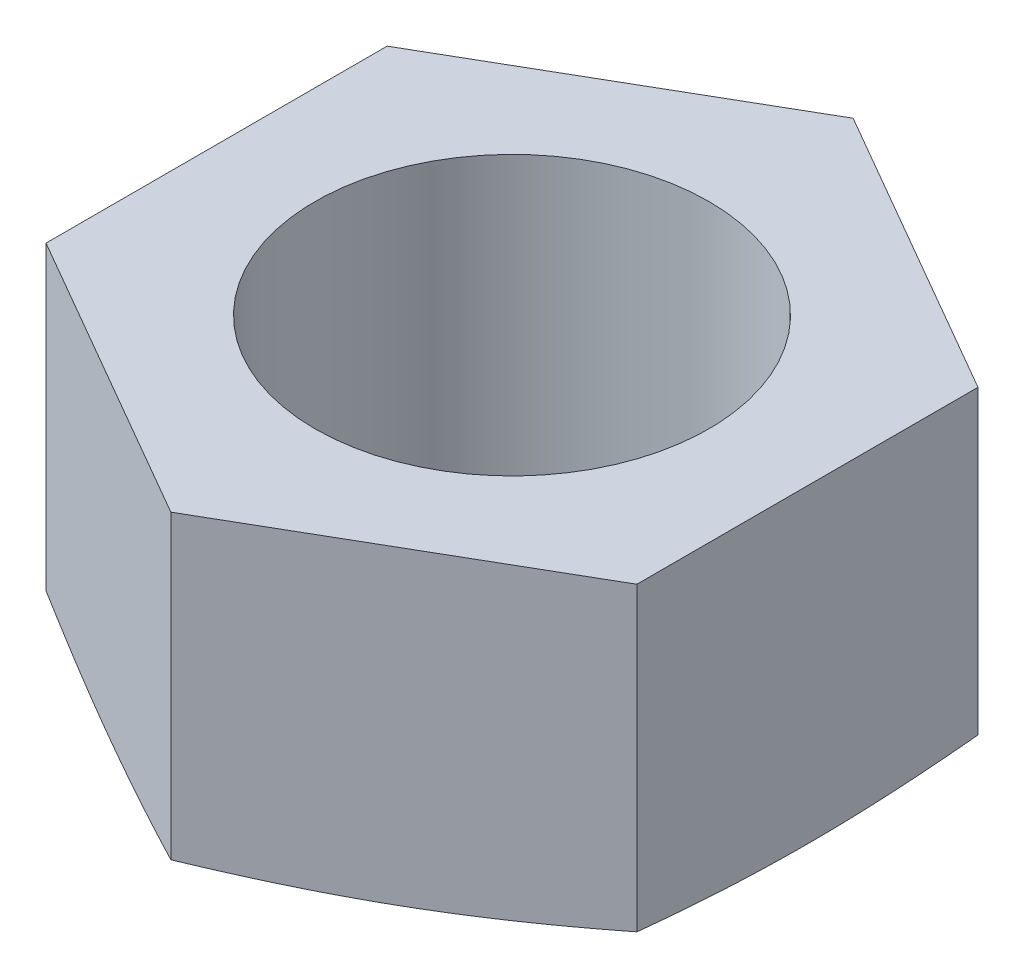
ISO-10303-21;
HEADER;
FILE_DESCRIPTION(('STEP AP214'),'2;1');
FILE_NAME('part.step','',(''),(''),'','','');
FILE_SCHEMA(('AUTOMOTIVE_DESIGN { 1 0 10303 214 1 1 1 1 }'));
ENDSEC;
DATA;
#1=APPLICATION_CONTEXT('core data for automotive mechanical design processes');
#2=APPLICATION_PROTOCOL_DEFINITION('international standard','automotive_design',2000,#1);
#3=PRODUCT_CONTEXT('',#1,'mechanical');
#4=PRODUCT('Part','Part','',(#3));
#5=PRODUCT_RELATED_PRODUCT_CATEGORY('part','',(#4));
#6=PRODUCT_DEFINITION_FORMATION('','',#4);
#7=PRODUCT_DEFINITION_CONTEXT('part definition',#1,'design');
#8=PRODUCT_DEFINITION('design','',#6,#7);
#9=PRODUCT_DEFINITION_SHAPE('','',#8);
#10=(LENGTH_UNIT() NAMED_UNIT(*) SI_UNIT(.MILLI.,.METRE.));
#11=(NAMED_UNIT(*) PLANE_ANGLE_UNIT() SI_UNIT($,.RADIAN.));
#12=(NAMED_UNIT(*) SI_UNIT($,.STERADIAN.) SOLID_ANGLE_UNIT());
#13=UNCERTAINTY_MEASURE_WITH_UNIT(LENGTH_MEASURE(1.E-05),#10,'distance_accuracy_value','');
#14=(GEOMETRIC_REPRESENTATION_CONTEXT(3) GLOBAL_UNCERTAINTY_ASSIGNED_CONTEXT((#13)) GLOBAL_UNIT_ASSIGNED_CONTEXT((#10,
#11,#12)) REPRESENTATION_CONTEXT('',''));
#15=CARTESIAN_POINT('',(0.,0.,0.));
#16=DIRECTION('',(0.,0.,1.));
#17=DIRECTION('',(1.,0.,0.));
#18=AXIS2_PLACEMENT_3D('',#15,#16,#17);
#19=CARTESIAN_POINT('',(12.,14.,6.92820323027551));
#20=DIRECTION('',(-1.,0.,0.));
#21=DIRECTION('',(0.,0.,1.));
#22=AXIS2_PLACEMENT_3D('',#19,#20,#21);
#23=PLANE('',#22);
#24=DIRECTION('',(0.,0.,-1.));
#25=VECTOR('',#24,1.);
#26=CARTESIAN_POINT('',(12.,13.,0.));
#27=LINE('',#26,#25);
#28=CARTESIAN_POINT('',(12.,13.,-6.92820323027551));
#29=VERTEX_POINT('',#28);
#30=CARTESIAN_POINT('',(12.,13.,6.92820323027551));
#31=VERTEX_POINT('',#30);
#32=EDGE_CURVE('E96',#29,#31,#27,.F.);
#33=ORIENTED_EDGE('',*,*,#32,.T.);
#34=DIRECTION('',(0.,1.,0.));
#35=VECTOR('',#34,1.);
#36=CARTESIAN_POINT('',(12.,14.,6.92820323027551));
#37=LINE('',#36,#35);
#38=CARTESIAN_POINT('',(12.,0.771281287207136,6.92820318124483));
#39=VERTEX_POINT('',#38);
#40=EDGE_CURVE('E85',#31,#39,#37,.F.);
#41=ORIENTED_EDGE('',*,*,#40,.T.);
#42=CARTESIAN_POINT('',(11.9999999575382,0.771281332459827,-6.9282032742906));
#43=CARTESIAN_POINT('',(11.9999999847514,0.713631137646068,-6.35193258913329));
#44=CARTESIAN_POINT('',(11.9999999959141,0.661350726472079,-5.77507541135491));
#45=CARTESIAN_POINT('',(12.0000000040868,0.569566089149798,-4.6202248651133));
#46=CARTESIAN_POINT('',(12.0000000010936,0.530064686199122,-4.0422312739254));
#47=CARTESIAN_POINT('',(11.9999999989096,0.465994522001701,-2.88706839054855));
#48=CARTESIAN_POINT('',(11.9999999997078,0.44138299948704,-2.30990153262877));
#49=CARTESIAN_POINT('',(12.0000000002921,0.408386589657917,-1.15515644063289));
#50=CARTESIAN_POINT('',(12.0000000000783,0.400000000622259,-0.577578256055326));
#51=CARTESIAN_POINT('',(11.9999999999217,0.399999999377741,0.577578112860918));
#52=CARTESIAN_POINT('',(11.9999999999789,0.408386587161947,1.1551562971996));
#53=CARTESIAN_POINT('',(12.0000000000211,0.441382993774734,2.30990138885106));
#54=CARTESIAN_POINT('',(12.000000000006,0.465994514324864,2.8870682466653));
#55=CARTESIAN_POINT('',(11.9999999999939,0.530064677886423,4.04223112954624));
#56=CARTESIAN_POINT('',(11.999999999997,0.569566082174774,4.62022472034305));
#57=CARTESIAN_POINT('',(12.000000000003,0.661350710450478,5.77507526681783));
#58=CARTESIAN_POINT('',(12.000000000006,0.713631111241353,6.35193244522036));
#59=CARTESIAN_POINT('',(12.,0.771281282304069,6.92820313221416));
#60=B_SPLINE_CURVE_WITH_KNOTS('',3,(#42,#43,#44,#45,#46,#47,#48,#49,#50,#51,#52,#53,#54,#55,#56,
#57,#58,#59),.UNSPECIFIED.,.F.,.F.,(4,2,2,2,2,2,2,2,4),(0.,1.73749036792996,3.47536432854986,
5.20822341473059,6.94090074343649,8.67357807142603,10.406437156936,12.1443111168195,
13.8818014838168),.UNSPECIFIED.);
#61=CARTESIAN_POINT('',(11.9999999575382,0.771281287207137,-6.92820325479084));
#62=VERTEX_POINT('',#61);
#63=EDGE_CURVE('E94',#62,#39,#60,.T.);
#64=ORIENTED_EDGE('',*,*,#63,.F.);
#65=DIRECTION('',(0.,1.,0.));
#66=VECTOR('',#65,1.);
#67=CARTESIAN_POINT('',(12.,14.,-6.92820323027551));
#68=LINE('',#67,#66);
#69=EDGE_CURVE('E102',#62,#29,#68,.T.);
#70=ORIENTED_EDGE('',*,*,#69,.T.);
#71=EDGE_LOOP('',(#33,#41,#64,#70));
#72=FACE_BOUND('',#71,.T.);
#73=ADVANCED_FACE('F17',(#72),#23,.F.);
#74=CARTESIAN_POINT('',(0.,14.,13.856406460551));
#75=DIRECTION('',(-0.5,0.,-0.866025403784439));
#76=DIRECTION('',(-0.866025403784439,0.,0.5));
#77=AXIS2_PLACEMENT_3D('',#74,#75,#76);
#78=PLANE('',#77);
#79=DIRECTION('',(-0.866025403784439,0.,0.5));
#80=VECTOR('',#79,1.);
#81=CARTESIAN_POINT('',(12.,13.,6.92820323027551));
#82=LINE('',#81,#80);
#83=CARTESIAN_POINT('',(0.,13.,13.856406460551));
#84=VERTEX_POINT('',#83);
#85=EDGE_CURVE('E79',#31,#84,#82,.T.);
#86=ORIENTED_EDGE('',*,*,#85,.T.);
#87=DIRECTION('',(0.,1.,0.));
#88=VECTOR('',#87,1.);
#89=CARTESIAN_POINT('',(0.,14.,13.856406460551));
#90=LINE('',#89,#88);
#91=CARTESIAN_POINT('',(0.,0.771281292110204,13.856406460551));
#92=VERTEX_POINT('',#91);
#93=EDGE_CURVE('E74',#84,#92,#90,.F.);
#94=ORIENTED_EDGE('',*,*,#93,.T.);
#95=CARTESIAN_POINT('',(12.0000000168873,0.771281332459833,6.92820317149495));
#96=CARTESIAN_POINT('',(11.5009349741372,0.713631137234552,7.21633853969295));
#97=CARTESIAN_POINT('',(11.001362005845,0.661350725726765,7.50476714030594));
#98=CARTESIAN_POINT('',(10.0012320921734,0.569566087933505,8.08219242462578));
#99=CARTESIAN_POINT('',(9.50067495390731,0.530064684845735,8.37118921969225));
#100=CARTESIAN_POINT('',(8.50027454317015,0.465994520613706,8.9487706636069));
#101=CARTESIAN_POINT('',(8.0004333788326,0.441382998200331,9.23735409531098));
#102=CARTESIAN_POINT('',(7.00039478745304,0.408386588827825,9.81472664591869));
#103=CARTESIAN_POINT('',(6.50019740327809,0.400000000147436,10.1035157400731));
#104=CARTESIAN_POINT('',(5.49980263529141,0.399999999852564,10.6810939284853));
#105=CARTESIAN_POINT('',(4.99960525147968,0.408386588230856,10.969883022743));
#106=CARTESIAN_POINT('',(3.99956666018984,0.441382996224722,11.5472555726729));
#107=CARTESIAN_POINT('',(3.49972549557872,0.465994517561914,11.8358390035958));
#108=CARTESIAN_POINT('',(2.49932508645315,0.530064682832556,12.4134204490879));
#109=CARTESIAN_POINT('',(1.9987679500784,0.569566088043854,12.7024172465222));
#110=CARTESIAN_POINT('',(0.998638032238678,0.66135071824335,13.2798425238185));
#111=CARTESIAN_POINT('',(0.499065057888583,0.713631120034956,13.5682711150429));
#112=CARTESIAN_POINT('',(0.,0.771281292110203,13.856406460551));
#113=B_SPLINE_CURVE_WITH_KNOTS('',3,(#95,#96,#97,#98,#99,#100,#101,#102,#103,#104,#105,#106,
#107,#108,#109,#110,#111,#112),.UNSPECIFIED.,.F.,.F.,(4,2,2,2,2,2,2,2,4),(0.,1.73749038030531,
3.47536435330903,5.20822345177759,6.94090079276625,8.67357813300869,10.4064372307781,
12.1443112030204,13.8818015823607),.UNSPECIFIED.);
#114=EDGE_CURVE('E77',#39,#92,#113,.T.);
#115=ORIENTED_EDGE('',*,*,#114,.F.);
#116=ORIENTED_EDGE('',*,*,#40,.F.);
#117=EDGE_LOOP('',(#86,#94,#115,#116));
#118=FACE_BOUND('',#117,.T.);
#119=ADVANCED_FACE('F76',(#118),#78,.F.);
#120=CARTESIAN_POINT('',(-12.,14.,6.92820323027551));
#121=DIRECTION('',(0.5,0.,-0.866025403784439));
#122=DIRECTION('',(-0.866025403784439,0.,-0.5));
#123=AXIS2_PLACEMENT_3D('',#120,#121,#122);
#124=PLANE('',#123);
#125=DIRECTION('',(-0.866025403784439,0.,-0.5));
#126=VECTOR('',#125,1.);
#127=CARTESIAN_POINT('',(0.,13.,13.856406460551));
#128=LINE('',#127,#126);
#129=CARTESIAN_POINT('',(-12.,13.,6.92820323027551));
#130=VERTEX_POINT('',#129);
#131=EDGE_CURVE('E143',#84,#130,#128,.T.);
#132=ORIENTED_EDGE('',*,*,#131,.T.);
#133=DIRECTION('',(0.,1.,0.));
#134=VECTOR('',#133,1.);
#135=CARTESIAN_POINT('',(-12.,14.,6.92820323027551));
#136=LINE('',#135,#134);
#137=CARTESIAN_POINT('',(-11.9999999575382,0.771281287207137,6.92820325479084));
#138=VERTEX_POINT('',#137);
#139=EDGE_CURVE('E84',#130,#138,#136,.F.);
#140=ORIENTED_EDGE('',*,*,#139,.T.);
#141=CARTESIAN_POINT('',(0.,0.771281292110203,13.856406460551));
#142=CARTESIAN_POINT('',(-0.499065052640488,0.713631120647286,13.5682711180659));
#143=CARTESIAN_POINT('',(-0.998638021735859,0.661350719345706,13.2798425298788));
#144=CARTESIAN_POINT('',(-1.99876792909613,0.569566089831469,12.7024172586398));
#145=CARTESIAN_POINT('',(-2.49932506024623,0.530064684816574,12.4134204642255));
#146=CARTESIAN_POINT('',(-3.49972545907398,0.46599451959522,11.8358390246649));
#147=CARTESIAN_POINT('',(-3.99956661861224,0.441382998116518,11.5472555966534));
#148=CARTESIAN_POINT('',(-4.99960519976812,0.408386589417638,10.969883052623));
#149=CARTESIAN_POINT('',(-5.49980257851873,0.400000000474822,10.6810939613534));
#150=CARTESIAN_POINT('',(-6.50019733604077,0.399999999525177,10.1035157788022));
#151=CARTESIAN_POINT('',(-7.00039471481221,0.408386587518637,9.81472668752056));
#152=CARTESIAN_POINT('',(-8.00043329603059,0.441382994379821,9.23735414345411));
#153=CARTESIAN_POINT('',(-8.50027445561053,0.465994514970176,8.94877071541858));
#154=CARTESIAN_POINT('',(-9.50067485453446,0.530064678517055,8.37118927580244));
#155=CARTESIAN_POINT('',(-10.0012319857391,0.569566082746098,8.08219248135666));
#156=CARTESIAN_POINT('',(-11.0013618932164,0.66135071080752,7.50476721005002));
#157=CARTESIAN_POINT('',(-11.5009348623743,0.713631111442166,7.21633862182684));
#158=CARTESIAN_POINT('',(-11.9999999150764,0.77128128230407,6.92820327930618));
#159=B_SPLINE_CURVE_WITH_KNOTS('',3,(#141,#142,#143,#144,#145,#146,#147,#148,#149,#150,#151,
#152,#153,#154,#155,#156,#157,#158),.UNSPECIFIED.,.F.,.F.,(4,2,2,2,2,2,2,2,4),(0.,
1.73749036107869,3.47536431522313,5.2082233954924,6.94090071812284,8.67357804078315,
10.4064371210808,12.1443110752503,13.8818014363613),.UNSPECIFIED.);
#160=EDGE_CURVE('E21',#92,#138,#159,.T.);
#161=ORIENTED_EDGE('',*,*,#160,.F.);
#162=ORIENTED_EDGE('',*,*,#93,.F.);
#163=EDGE_LOOP('',(#132,#140,#161,#162));
#164=FACE_BOUND('',#163,.T.);
#165=ADVANCED_FACE('F98',(#164),#124,.F.);
#166=CARTESIAN_POINT('',(-12.,14.,-6.92820323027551));
#167=DIRECTION('',(1.,0.,0.));
#168=DIRECTION('',(0.,0.,-1.));
#169=AXIS2_PLACEMENT_3D('',#166,#167,#168);
#170=PLANE('',#169);
#171=DIRECTION('',(0.,0.,-1.));
#172=VECTOR('',#171,1.);
#173=CARTESIAN_POINT('',(-12.,13.,0.));
#174=LINE('',#173,#172);
#175=CARTESIAN_POINT('',(-12.,13.,-6.92820323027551));
#176=VERTEX_POINT('',#175);
#177=EDGE_CURVE('E134',#130,#176,#174,.T.);
#178=ORIENTED_EDGE('',*,*,#177,.T.);
#179=DIRECTION('',(0.,1.,0.));
#180=VECTOR('',#179,1.);
#181=CARTESIAN_POINT('',(-12.,14.,-6.92820323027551));
#182=LINE('',#181,#180);
#183=CARTESIAN_POINT('',(-12.,0.771281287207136,-6.92820318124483));
#184=VERTEX_POINT('',#183);
#185=EDGE_CURVE('E108',#176,#184,#182,.F.);
#186=ORIENTED_EDGE('',*,*,#185,.T.);
#187=CARTESIAN_POINT('',(-11.9999999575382,0.771281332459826,6.9282032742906));
#188=CARTESIAN_POINT('',(-11.9999999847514,0.713631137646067,6.35193258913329));
#189=CARTESIAN_POINT('',(-11.9999999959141,0.661350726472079,5.77507541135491));
#190=CARTESIAN_POINT('',(-12.0000000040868,0.569566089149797,4.6202248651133));
#191=CARTESIAN_POINT('',(-12.0000000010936,0.530064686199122,4.0422312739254));
#192=CARTESIAN_POINT('',(-11.9999999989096,0.465994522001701,2.88706839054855));
#193=CARTESIAN_POINT('',(-11.9999999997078,0.441382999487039,2.30990153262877));
#194=CARTESIAN_POINT('',(-12.0000000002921,0.408386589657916,1.15515644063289));
#195=CARTESIAN_POINT('',(-12.0000000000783,0.400000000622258,0.577578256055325));
#196=CARTESIAN_POINT('',(-11.9999999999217,0.399999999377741,-0.577578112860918));
#197=CARTESIAN_POINT('',(-11.9999999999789,0.408386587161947,-1.1551562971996));
#198=CARTESIAN_POINT('',(-12.0000000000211,0.441382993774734,-2.30990138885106));
#199=CARTESIAN_POINT('',(-12.000000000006,0.465994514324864,-2.8870682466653));
#200=CARTESIAN_POINT('',(-11.9999999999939,0.530064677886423,-4.04223112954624));
#201=CARTESIAN_POINT('',(-11.999999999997,0.569566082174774,-4.62022472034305));
#202=CARTESIAN_POINT('',(-12.000000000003,0.661350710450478,-5.77507526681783));
#203=CARTESIAN_POINT('',(-12.000000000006,0.713631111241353,-6.35193244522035));
#204=CARTESIAN_POINT('',(-12.,0.771281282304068,-6.92820313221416));
#205=B_SPLINE_CURVE_WITH_KNOTS('',3,(#187,#188,#189,#190,#191,#192,#193,#194,#195,#196,#197,
#198,#199,#200,#201,#202,#203,#204),.UNSPECIFIED.,.F.,.F.,(4,2,2,2,2,2,2,2,4),(0.,
1.73749036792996,3.47536432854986,5.20822341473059,6.94090074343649,8.67357807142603,
10.406437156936,12.1443111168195,13.8818014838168),.UNSPECIFIED.);
#206=EDGE_CURVE('E100',#138,#184,#205,.T.);
#207=ORIENTED_EDGE('',*,*,#206,.F.);
#208=ORIENTED_EDGE('',*,*,#139,.F.);
#209=EDGE_LOOP('',(#178,#186,#207,#208));
#210=FACE_BOUND('',#209,.T.);
#211=ADVANCED_FACE('F186',(#210),#170,.F.);
#212=CARTESIAN_POINT('',(0.,14.,-13.856406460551));
#213=DIRECTION('',(0.5,0.,0.866025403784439));
#214=DIRECTION('',(0.866025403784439,0.,-0.5));
#215=AXIS2_PLACEMENT_3D('',#212,#213,#214);
#216=PLANE('',#215);
#217=DIRECTION('',(0.866025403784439,0.,-0.5));
#218=VECTOR('',#217,1.);
#219=CARTESIAN_POINT('',(-12.,13.,-6.92820323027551));
#220=LINE('',#219,#218);
#221=CARTESIAN_POINT('',(0.,13.,-13.856406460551));
#222=VERTEX_POINT('',#221);
#223=EDGE_CURVE('E130',#176,#222,#220,.T.);
#224=ORIENTED_EDGE('',*,*,#223,.T.);
#225=DIRECTION('',(0.,1.,0.));
#226=VECTOR('',#225,1.);
#227=CARTESIAN_POINT('',(0.,14.,-13.856406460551));
#228=LINE('',#227,#226);
#229=CARTESIAN_POINT('',(0.,0.771281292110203,-13.856406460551));
#230=VERTEX_POINT('',#229);
#231=EDGE_CURVE('E41',#222,#230,#228,.F.);
#232=ORIENTED_EDGE('',*,*,#231,.T.);
#233=CARTESIAN_POINT('',(-12.0000000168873,0.771281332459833,-6.92820317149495));
#234=CARTESIAN_POINT('',(-11.5009349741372,0.713631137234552,-7.21633853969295));
#235=CARTESIAN_POINT('',(-11.001362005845,0.661350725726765,-7.50476714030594));
#236=CARTESIAN_POINT('',(-10.0012320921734,0.569566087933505,-8.08219242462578));
#237=CARTESIAN_POINT('',(-9.50067495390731,0.530064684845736,-8.37118921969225));
#238=CARTESIAN_POINT('',(-8.50027454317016,0.465994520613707,-8.9487706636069));
#239=CARTESIAN_POINT('',(-8.0004333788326,0.441382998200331,-9.23735409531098));
#240=CARTESIAN_POINT('',(-7.00039478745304,0.408386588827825,-9.81472664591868));
#241=CARTESIAN_POINT('',(-6.50019740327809,0.400000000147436,-10.1035157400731));
#242=CARTESIAN_POINT('',(-5.49980263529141,0.399999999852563,-10.6810939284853));
#243=CARTESIAN_POINT('',(-4.99960525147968,0.408386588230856,-10.969883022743));
#244=CARTESIAN_POINT('',(-3.99956666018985,0.441382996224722,-11.5472555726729));
#245=CARTESIAN_POINT('',(-3.49972549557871,0.465994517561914,-11.8358390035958));
#246=CARTESIAN_POINT('',(-2.49932508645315,0.530064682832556,-12.4134204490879));
#247=CARTESIAN_POINT('',(-1.9987679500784,0.569566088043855,-12.7024172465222));
#248=CARTESIAN_POINT('',(-0.998638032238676,0.66135071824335,-13.2798425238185));
#249=CARTESIAN_POINT('',(-0.499065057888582,0.713631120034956,-13.5682711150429));
#250=CARTESIAN_POINT('',(0.,0.771281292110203,-13.856406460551));
#251=B_SPLINE_CURVE_WITH_KNOTS('',3,(#233,#234,#235,#236,#237,#238,#239,#240,#241,#242,#243,
#244,#245,#246,#247,#248,#249,#250),.UNSPECIFIED.,.F.,.F.,(4,2,2,2,2,2,2,2,4),(0.,
1.73749038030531,3.47536435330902,5.20822345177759,6.94090079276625,8.67357813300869,
10.4064372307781,12.1443112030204,13.8818015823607),.UNSPECIFIED.);
#252=EDGE_CURVE('E101',#184,#230,#251,.T.);
#253=ORIENTED_EDGE('',*,*,#252,.F.);
#254=ORIENTED_EDGE('',*,*,#185,.F.);
#255=EDGE_LOOP('',(#224,#232,#253,#254));
#256=FACE_BOUND('',#255,.T.);
#257=ADVANCED_FACE('F189',(#256),#216,.F.);
#258=CARTESIAN_POINT('',(12.,14.,-6.92820323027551));
#259=DIRECTION('',(-0.5,0.,0.866025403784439));
#260=DIRECTION('',(0.866025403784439,0.,0.5));
#261=AXIS2_PLACEMENT_3D('',#258,#259,#260);
#262=PLANE('',#261);
#263=DIRECTION('',(0.866025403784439,0.,0.5));
#264=VECTOR('',#263,1.);
#265=CARTESIAN_POINT('',(0.,13.,-13.856406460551));
#266=LINE('',#265,#264);
#267=EDGE_CURVE('E127',#222,#29,#266,.T.);
#268=ORIENTED_EDGE('',*,*,#267,.T.);
#269=ORIENTED_EDGE('',*,*,#69,.F.);
#270=CARTESIAN_POINT('',(0.,0.771281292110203,-13.856406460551));
#271=CARTESIAN_POINT('',(0.499065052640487,0.713631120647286,-13.5682711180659));
#272=CARTESIAN_POINT('',(0.998638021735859,0.661350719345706,-13.2798425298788));
#273=CARTESIAN_POINT('',(1.99876792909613,0.569566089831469,-12.7024172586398));
#274=CARTESIAN_POINT('',(2.49932506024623,0.530064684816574,-12.4134204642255));
#275=CARTESIAN_POINT('',(3.49972545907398,0.46599451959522,-11.8358390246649));
#276=CARTESIAN_POINT('',(3.99956661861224,0.441382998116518,-11.5472555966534));
#277=CARTESIAN_POINT('',(4.99960519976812,0.408386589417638,-10.969883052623));
#278=CARTESIAN_POINT('',(5.49980257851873,0.400000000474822,-10.6810939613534));
#279=CARTESIAN_POINT('',(6.50019733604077,0.399999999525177,-10.1035157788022));
#280=CARTESIAN_POINT('',(7.00039471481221,0.408386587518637,-9.81472668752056));
#281=CARTESIAN_POINT('',(8.00043329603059,0.441382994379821,-9.23735414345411));
#282=CARTESIAN_POINT('',(8.50027445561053,0.465994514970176,-8.94877071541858));
#283=CARTESIAN_POINT('',(9.50067485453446,0.530064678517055,-8.37118927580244));
#284=CARTESIAN_POINT('',(10.0012319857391,0.569566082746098,-8.08219248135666));
#285=CARTESIAN_POINT('',(11.0013618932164,0.66135071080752,-7.50476721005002));
#286=CARTESIAN_POINT('',(11.5009348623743,0.713631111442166,-7.21633862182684));
#287=CARTESIAN_POINT('',(11.9999999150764,0.771281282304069,-6.92820327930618));
#288=B_SPLINE_CURVE_WITH_KNOTS('',3,(#270,#271,#272,#273,#274,#275,#276,#277,#278,#279,#280,
#281,#282,#283,#284,#285,#286,#287),.UNSPECIFIED.,.F.,.F.,(4,2,2,2,2,2,2,2,4),(0.,
1.73749036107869,3.47536431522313,5.2082233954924,6.94090071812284,8.67357804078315,
10.4064371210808,12.1443110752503,13.8818014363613),.UNSPECIFIED.);
#289=EDGE_CURVE('E217',#230,#62,#288,.T.);
#290=ORIENTED_EDGE('',*,*,#289,.F.);
#291=ORIENTED_EDGE('',*,*,#231,.F.);
#292=EDGE_LOOP('',(#268,#269,#290,#291));
#293=FACE_BOUND('',#292,.T.);
#294=ADVANCED_FACE('F169',(#293),#262,.F.);
#295=CARTESIAN_POINT('',(0.,0.775908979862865,0.));
#296=DIRECTION('',(0.,1.,0.));
#297=DIRECTION('',(0.,0.,1.));
#298=AXIS2_PLACEMENT_3D('',#295,#296,#297);
#299=CONICAL_SURFACE('',#298,13.8795448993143,1.37340076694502);
#300=ORIENTED_EDGE('',*,*,#252,.T.);
#301=ORIENTED_EDGE('',*,*,#289,.T.);
#302=ORIENTED_EDGE('',*,*,#63,.T.);
#303=ORIENTED_EDGE('',*,*,#114,.T.);
#304=ORIENTED_EDGE('',*,*,#160,.T.);
#305=ORIENTED_EDGE('',*,*,#206,.T.);
#306=EDGE_LOOP('',(#300,#301,#302,#303,#304,#305));
#307=FACE_BOUND('',#306,.T.);
#308=CARTESIAN_POINT('',(0.,0.,0.));
#309=DIRECTION('',(0.,1.,0.));
#310=DIRECTION('',(0.,0.,1.));
#311=AXIS2_PLACEMENT_3D('',#308,#309,#310);
#312=CIRCLE('',#311,10.);
#313=CARTESIAN_POINT('',(0.,0.,10.));
#314=VERTEX_POINT('',#313);
#315=EDGE_CURVE('E129',#314,#314,#312,.T.);
#316=ORIENTED_EDGE('',*,*,#315,.T.);
#317=EDGE_LOOP('',(#316));
#318=FACE_BOUND('',#317,.T.);
#319=ADVANCED_FACE('F89',(#307,#318),#299,.T.);
#320=CARTESIAN_POINT('',(15.,13.,0.));
#321=DIRECTION('',(0.,-1.,0.));
#322=DIRECTION('',(0.,0.,-1.));
#323=AXIS2_PLACEMENT_3D('',#320,#321,#322);
#324=PLANE('',#323);
#325=CARTESIAN_POINT('',(0.,13.,0.));
#326=DIRECTION('',(0.,1.,0.));
#327=DIRECTION('',(0.,0.,1.));
#328=AXIS2_PLACEMENT_3D('',#325,#326,#327);
#329=CIRCLE('',#328,8.);
#330=CARTESIAN_POINT('',(0.,13.,8.));
#331=VERTEX_POINT('',#330);
#332=EDGE_CURVE('E32',#331,#331,#329,.F.);
#333=ORIENTED_EDGE('',*,*,#332,.T.);
#334=EDGE_LOOP('',(#333));
#335=FACE_BOUND('',#334,.T.);
#336=ORIENTED_EDGE('',*,*,#223,.F.);
#337=ORIENTED_EDGE('',*,*,#177,.F.);
#338=ORIENTED_EDGE('',*,*,#131,.F.);
#339=ORIENTED_EDGE('',*,*,#85,.F.);
#340=ORIENTED_EDGE('',*,*,#32,.F.);
#341=ORIENTED_EDGE('',*,*,#267,.F.);
#342=EDGE_LOOP('',(#336,#337,#338,#339,#340,#341));
#343=FACE_BOUND('',#342,.T.);
#344=ADVANCED_FACE('F168',(#335,#343),#324,.F.);
#345=CARTESIAN_POINT('',(8.,0.,0.));
#346=DIRECTION('',(0.,1.,0.));
#347=DIRECTION('',(0.,0.,1.));
#348=AXIS2_PLACEMENT_3D('',#345,#346,#347);
#349=PLANE('',#348);
#350=CARTESIAN_POINT('',(0.,0.,0.));
#351=DIRECTION('',(0.,1.,0.));
#352=DIRECTION('',(0.,0.,1.));
#353=AXIS2_PLACEMENT_3D('',#350,#351,#352);
#354=CIRCLE('',#353,8.);
#355=CARTESIAN_POINT('',(0.,0.,8.));
#356=VERTEX_POINT('',#355);
#357=EDGE_CURVE('E11',#356,#356,#354,.T.);
#358=ORIENTED_EDGE('',*,*,#357,.T.);
#359=EDGE_LOOP('',(#358));
#360=FACE_BOUND('',#359,.T.);
#361=ORIENTED_EDGE('',*,*,#315,.F.);
#362=EDGE_LOOP('',(#361));
#363=FACE_BOUND('',#362,.T.);
#364=ADVANCED_FACE('F200',(#360,#363),#349,.F.);
#365=CARTESIAN_POINT('',(0.,0.,0.));
#366=DIRECTION('',(0.,1.,0.));
#367=DIRECTION('',(0.,0.,1.));
#368=AXIS2_PLACEMENT_3D('',#365,#366,#367);
#369=CYLINDRICAL_SURFACE('',#368,8.);
#370=ORIENTED_EDGE('',*,*,#332,.F.);
#371=EDGE_LOOP('',(#370));
#372=FACE_BOUND('',#371,.T.);
#373=ORIENTED_EDGE('',*,*,#357,.F.);
#374=EDGE_LOOP('',(#373));
#375=FACE_BOUND('',#374,.T.);
#376=ADVANCED_FACE('F198',(#372,#375),#369,.F.);
#377=CLOSED_SHELL('',(#73,#119,#165,#211,#257,#294,#319,#344,#364,#376));
#378=MANIFOLD_SOLID_BREP('B1',#377);
#379=ADVANCED_BREP_SHAPE_REPRESENTATION('',(#18,#378),#14);
#380=SHAPE_DEFINITION_REPRESENTATION(#9,#379);
ENDSEC;
END-ISO-10303-21;
